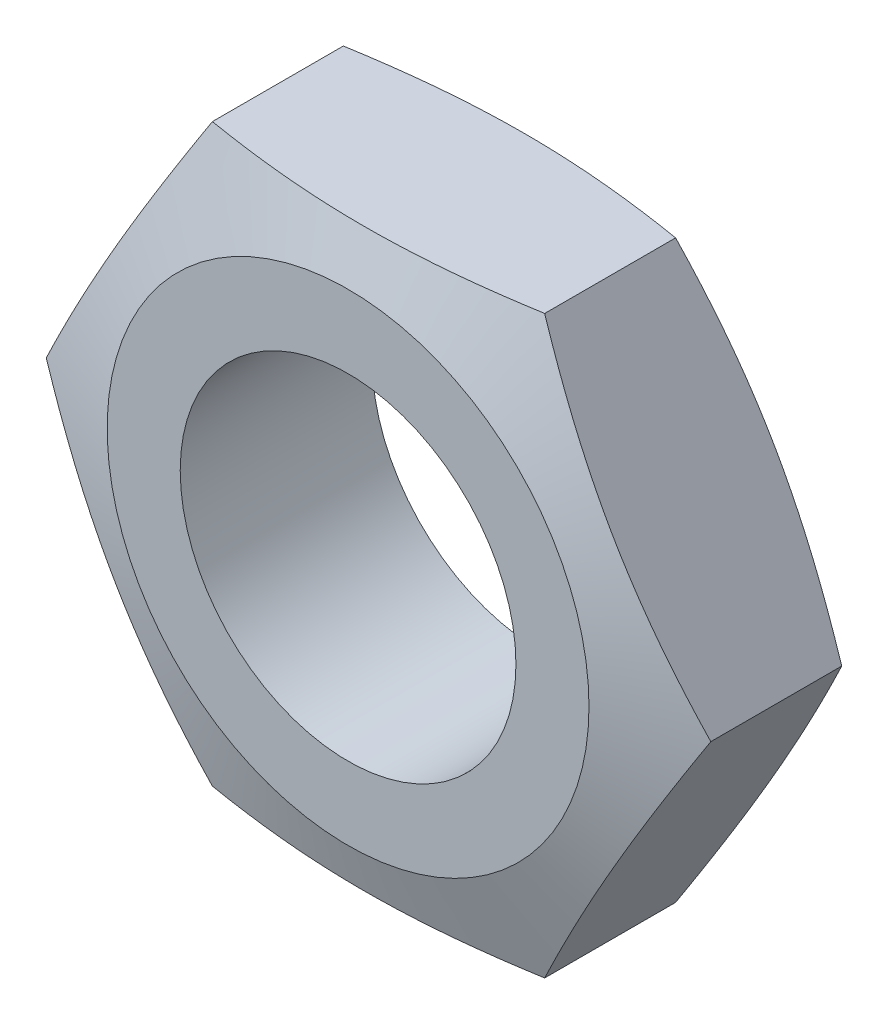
ISO-10303-21;
HEADER;
FILE_DESCRIPTION(('STEP AP214'),'2;1');
FILE_NAME('part.step','',(''),(''),'','','');
FILE_SCHEMA(('AUTOMOTIVE_DESIGN { 1 0 10303 214 1 1 1 1 }'));
ENDSEC;
DATA;
#1=APPLICATION_CONTEXT('core data for automotive mechanical design processes');
#2=APPLICATION_PROTOCOL_DEFINITION('international standard','automotive_design',2000,#1);
#3=PRODUCT_CONTEXT('',#1,'mechanical');
#4=PRODUCT('Part','Part','',(#3));
#5=PRODUCT_RELATED_PRODUCT_CATEGORY('part','',(#4));
#6=PRODUCT_DEFINITION_FORMATION('','',#4);
#7=PRODUCT_DEFINITION_CONTEXT('part definition',#1,'design');
#8=PRODUCT_DEFINITION('design','',#6,#7);
#9=PRODUCT_DEFINITION_SHAPE('','',#8);
#10=(LENGTH_UNIT() NAMED_UNIT(*) SI_UNIT(.MILLI.,.METRE.));
#11=(NAMED_UNIT(*) PLANE_ANGLE_UNIT() SI_UNIT($,.RADIAN.));
#12=(NAMED_UNIT(*) SI_UNIT($,.STERADIAN.) SOLID_ANGLE_UNIT());
#13=UNCERTAINTY_MEASURE_WITH_UNIT(LENGTH_MEASURE(1.E-05),#10,'distance_accuracy_value','');
#14=(GEOMETRIC_REPRESENTATION_CONTEXT(3) GLOBAL_UNCERTAINTY_ASSIGNED_CONTEXT((#13)) GLOBAL_UNIT_ASSIGNED_CONTEXT((#10,
#11,#12)) REPRESENTATION_CONTEXT('',''));
#15=CARTESIAN_POINT('',(0.,0.,0.));
#16=DIRECTION('',(0.,0.,1.));
#17=DIRECTION('',(1.,0.,0.));
#18=AXIS2_PLACEMENT_3D('',#15,#16,#17);
#19=CARTESIAN_POINT('',(-13.856406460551,0.,4.));
#20=DIRECTION('',(0.,0.,1.));
#21=DIRECTION('',(1.,0.,0.));
#22=AXIS2_PLACEMENT_3D('',#19,#20,#21);
#23=PLANE('',#22);
#24=CARTESIAN_POINT('',(0.,0.,4.));
#25=DIRECTION('',(0.,0.,1.));
#26=DIRECTION('',(1.,0.,0.));
#27=AXIS2_PLACEMENT_3D('',#24,#25,#26);
#28=CIRCLE('',#27,10.046406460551);
#29=CARTESIAN_POINT('',(10.046406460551,0.,4.));
#30=VERTEX_POINT('',#29);
#31=EDGE_CURVE('E114',#30,#30,#28,.T.);
#32=ORIENTED_EDGE('',*,*,#31,.T.);
#33=EDGE_LOOP('',(#32));
#34=FACE_BOUND('',#33,.T.);
#35=CARTESIAN_POINT('',(0.,0.,4.));
#36=DIRECTION('',(0.,0.,1.));
#37=DIRECTION('',(1.,0.,0.));
#38=AXIS2_PLACEMENT_3D('',#35,#36,#37);
#39=CIRCLE('',#38,7.);
#40=CARTESIAN_POINT('',(7.,0.,4.));
#41=VERTEX_POINT('',#40);
#42=EDGE_CURVE('E225',#41,#41,#39,.T.);
#43=ORIENTED_EDGE('',*,*,#42,.F.);
#44=EDGE_LOOP('',(#43));
#45=FACE_BOUND('',#44,.T.);
#46=ADVANCED_FACE('F40',(#34,#45),#23,.T.);
#47=CARTESIAN_POINT('',(-13.856406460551,0.,-4.));
#48=DIRECTION('',(0.,0.,1.));
#49=DIRECTION('',(1.,0.,0.));
#50=AXIS2_PLACEMENT_3D('',#47,#48,#49);
#51=PLANE('',#50);
#52=CARTESIAN_POINT('',(0.,0.,-4.));
#53=DIRECTION('',(0.,0.,1.));
#54=DIRECTION('',(1.,0.,0.));
#55=AXIS2_PLACEMENT_3D('',#52,#53,#54);
#56=CIRCLE('',#55,10.046406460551);
#57=CARTESIAN_POINT('',(10.046406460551,0.,-4.));
#58=VERTEX_POINT('',#57);
#59=EDGE_CURVE('E253',#58,#58,#56,.T.);
#60=ORIENTED_EDGE('',*,*,#59,.F.);
#61=EDGE_LOOP('',(#60));
#62=FACE_BOUND('',#61,.T.);
#63=CARTESIAN_POINT('',(0.,0.,-4.));
#64=DIRECTION('',(0.,0.,1.));
#65=DIRECTION('',(1.,0.,0.));
#66=AXIS2_PLACEMENT_3D('',#63,#64,#65);
#67=CIRCLE('',#66,7.);
#68=CARTESIAN_POINT('',(7.,0.,-4.));
#69=VERTEX_POINT('',#68);
#70=EDGE_CURVE('E224',#69,#69,#67,.T.);
#71=ORIENTED_EDGE('',*,*,#70,.T.);
#72=EDGE_LOOP('',(#71));
#73=FACE_BOUND('',#72,.T.);
#74=ADVANCED_FACE('F145',(#62,#73),#51,.F.);
#75=CARTESIAN_POINT('',(-6.92820323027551,12.,4.));
#76=DIRECTION('',(0.866025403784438,-0.5,0.));
#77=DIRECTION('',(0.5,0.866025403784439,0.));
#78=AXIS2_PLACEMENT_3D('',#75,#76,#77);
#79=PLANE('',#78);
#80=DIRECTION('',(0.,0.,-1.));
#81=VECTOR('',#80,1.);
#82=CARTESIAN_POINT('',(-13.856406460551,0.,4.));
#83=LINE('',#82,#81);
#84=CARTESIAN_POINT('',(-13.856406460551,0.,2.73));
#85=VERTEX_POINT('',#84);
#86=CARTESIAN_POINT('',(-13.856406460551,0.,-2.73));
#87=VERTEX_POINT('',#86);
#88=EDGE_CURVE('E128',#85,#87,#83,.T.);
#89=ORIENTED_EDGE('',*,*,#88,.F.);
#90=CARTESIAN_POINT('',(-13.8565219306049,-0.000199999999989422,2.72996150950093));
#91=CARTESIAN_POINT('',(-13.5693206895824,0.497247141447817,2.82573089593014));
#92=CARTESIAN_POINT('',(-13.2813210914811,0.996077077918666,2.9127879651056));
#93=CARTESIAN_POINT('',(-12.7037501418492,1.99645930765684,3.06587653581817));
#94=CARTESIAN_POINT('',(-12.4141778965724,2.49801314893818,3.13189444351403));
#95=CARTESIAN_POINT('',(-11.8361644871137,3.49916174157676,3.23874436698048));
#96=CARTESIAN_POINT('',(-11.547732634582,3.99874036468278,3.27977245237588));
#97=CARTESIAN_POINT('',(-10.9703020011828,4.9988795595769,3.33479716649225));
#98=CARTESIAN_POINT('',(-10.681303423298,5.49943977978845,3.348802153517));
#99=CARTESIAN_POINT('',(-10.1033062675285,6.50056022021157,3.348802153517));
#100=CARTESIAN_POINT('',(-9.81430768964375,7.00112044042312,3.33479716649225));
#101=CARTESIAN_POINT('',(-9.23687705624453,8.00125963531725,3.27977245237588));
#102=CARTESIAN_POINT('',(-8.94844520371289,8.50083825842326,3.23874436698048));
#103=CARTESIAN_POINT('',(-8.37043179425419,9.50198685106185,3.13189444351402));
#104=CARTESIAN_POINT('',(-8.08085954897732,10.0035406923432,3.06587653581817));
#105=CARTESIAN_POINT('',(-7.50328859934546,11.0039229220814,2.9127879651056));
#106=CARTESIAN_POINT('',(-7.21528900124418,11.5027528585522,2.82573089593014));
#107=CARTESIAN_POINT('',(-6.92808776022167,12.0002,2.72996150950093));
#108=B_SPLINE_CURVE_WITH_KNOTS('',3,(#90,#91,#92,#93,#94,#95,#96,#97,#98,#99,#100,#101,#102,
#103,#104,#105,#106,#107),.UNSPECIFIED.,.F.,.F.,(4,2,2,2,2,2,2,2,4),(0.,1.74714237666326,
3.49541134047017,5.22978053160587,6.96361319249,8.69744585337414,10.4318150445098,
12.1800840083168,13.92722638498),.UNSPECIFIED.);
#109=CARTESIAN_POINT('',(-6.92820323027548,12.,2.73));
#110=VERTEX_POINT('',#109);
#111=EDGE_CURVE('E192',#85,#110,#108,.T.);
#112=ORIENTED_EDGE('',*,*,#111,.T.);
#113=DIRECTION('',(0.,0.,-1.));
#114=VECTOR('',#113,1.);
#115=CARTESIAN_POINT('',(-6.92820323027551,12.,4.));
#116=LINE('',#115,#114);
#117=CARTESIAN_POINT('',(-6.92820323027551,12.,-2.72999999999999));
#118=VERTEX_POINT('',#117);
#119=EDGE_CURVE('E69',#110,#118,#116,.T.);
#120=ORIENTED_EDGE('',*,*,#119,.T.);
#121=CARTESIAN_POINT('',(-6.92808776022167,12.0002,-2.72996150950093));
#122=CARTESIAN_POINT('',(-7.21528900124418,11.5027528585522,-2.82573089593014));
#123=CARTESIAN_POINT('',(-7.50328859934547,11.0039229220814,-2.9127879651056));
#124=CARTESIAN_POINT('',(-8.08085954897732,10.0035406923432,-3.06587653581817));
#125=CARTESIAN_POINT('',(-8.37043179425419,9.50198685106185,-3.13189444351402));
#126=CARTESIAN_POINT('',(-8.94844520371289,8.50083825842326,-3.23874436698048));
#127=CARTESIAN_POINT('',(-9.23687705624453,8.00125963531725,-3.27977245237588));
#128=CARTESIAN_POINT('',(-9.81430768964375,7.00112044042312,-3.33479716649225));
#129=CARTESIAN_POINT('',(-10.1033062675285,6.50056022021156,-3.348802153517));
#130=CARTESIAN_POINT('',(-10.681303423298,5.49943977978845,-3.348802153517));
#131=CARTESIAN_POINT('',(-10.9703020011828,4.9988795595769,-3.33479716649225));
#132=CARTESIAN_POINT('',(-11.547732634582,3.99874036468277,-3.27977245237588));
#133=CARTESIAN_POINT('',(-11.8361644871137,3.49916174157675,-3.23874436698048));
#134=CARTESIAN_POINT('',(-12.4141778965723,2.49801314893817,-3.13189444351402));
#135=CARTESIAN_POINT('',(-12.7037501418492,1.99645930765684,-3.06587653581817));
#136=CARTESIAN_POINT('',(-13.2813210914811,0.996077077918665,-2.9127879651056));
#137=CARTESIAN_POINT('',(-13.5693206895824,0.497247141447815,-2.82573089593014));
#138=CARTESIAN_POINT('',(-13.8565219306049,-0.000199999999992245,-2.72996150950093));
#139=B_SPLINE_CURVE_WITH_KNOTS('',3,(#121,#122,#123,#124,#125,#126,#127,#128,#129,#130,#131,
#132,#133,#134,#135,#136,#137,#138),.UNSPECIFIED.,.F.,.F.,(4,2,2,2,2,2,2,2,4),(0.,
1.74714237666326,3.49541134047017,5.22978053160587,6.96361319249,8.69744585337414,
10.4318150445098,12.1800840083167,13.92722638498),.UNSPECIFIED.);
#140=EDGE_CURVE('E213',#118,#87,#139,.T.);
#141=ORIENTED_EDGE('',*,*,#140,.T.);
#142=EDGE_LOOP('',(#89,#112,#120,#141));
#143=FACE_BOUND('',#142,.T.);
#144=ADVANCED_FACE('F42',(#143),#79,.F.);
#145=CARTESIAN_POINT('',(-13.856406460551,0.,4.));
#146=DIRECTION('',(0.866025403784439,0.5,0.));
#147=DIRECTION('',(-0.5,0.866025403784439,0.));
#148=AXIS2_PLACEMENT_3D('',#145,#146,#147);
#149=PLANE('',#148);
#150=DIRECTION('',(0.,0.,-1.));
#151=VECTOR('',#150,1.);
#152=CARTESIAN_POINT('',(-6.92820323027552,-12.,4.));
#153=LINE('',#152,#151);
#154=CARTESIAN_POINT('',(-6.92820323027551,-12.,2.73));
#155=VERTEX_POINT('',#154);
#156=CARTESIAN_POINT('',(-6.92820323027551,-12.,-2.73));
#157=VERTEX_POINT('',#156);
#158=EDGE_CURVE('E122',#155,#157,#153,.T.);
#159=ORIENTED_EDGE('',*,*,#158,.F.);
#160=CARTESIAN_POINT('',(-6.92808776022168,-12.0002,2.72996150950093));
#161=CARTESIAN_POINT('',(-7.21528900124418,-11.5027528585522,2.82573089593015));
#162=CARTESIAN_POINT('',(-7.50328859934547,-11.0039229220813,2.9127879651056));
#163=CARTESIAN_POINT('',(-8.08085954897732,-10.0035406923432,3.06587653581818));
#164=CARTESIAN_POINT('',(-8.37043179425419,-9.50198685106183,3.13189444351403));
#165=CARTESIAN_POINT('',(-8.94844520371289,-8.50083825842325,3.23874436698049));
#166=CARTESIAN_POINT('',(-9.23687705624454,-8.00125963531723,3.27977245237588));
#167=CARTESIAN_POINT('',(-9.81430768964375,-7.0011204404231,3.33479716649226));
#168=CARTESIAN_POINT('',(-10.1033062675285,-6.50056022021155,3.348802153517));
#169=CARTESIAN_POINT('',(-10.681303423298,-5.49943977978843,3.348802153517));
#170=CARTESIAN_POINT('',(-10.9703020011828,-4.99887955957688,3.33479716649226));
#171=CARTESIAN_POINT('',(-11.547732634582,-3.99874036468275,3.27977245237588));
#172=CARTESIAN_POINT('',(-11.8361644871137,-3.49916174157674,3.23874436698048));
#173=CARTESIAN_POINT('',(-12.4141778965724,-2.49801314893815,3.13189444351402));
#174=CARTESIAN_POINT('',(-12.7037501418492,-1.99645930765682,3.06587653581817));
#175=CARTESIAN_POINT('',(-13.2813210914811,-0.996077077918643,2.9127879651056));
#176=CARTESIAN_POINT('',(-13.5693206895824,-0.497247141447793,2.82573089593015));
#177=CARTESIAN_POINT('',(-13.8565219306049,0.000200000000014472,2.72996150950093));
#178=B_SPLINE_CURVE_WITH_KNOTS('',3,(#160,#161,#162,#163,#164,#165,#166,#167,#168,#169,#170,
#171,#172,#173,#174,#175,#176,#177),.UNSPECIFIED.,.F.,.F.,(4,2,2,2,2,2,2,2,4),(0.,
1.74714237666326,3.49541134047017,5.22978053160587,6.96361319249,8.69744585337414,
10.4318150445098,12.1800840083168,13.92722638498),.UNSPECIFIED.);
#179=EDGE_CURVE('E186',#155,#85,#178,.T.);
#180=ORIENTED_EDGE('',*,*,#179,.T.);
#181=ORIENTED_EDGE('',*,*,#88,.T.);
#182=CARTESIAN_POINT('',(-13.8565219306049,0.000200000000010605,-2.72996150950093));
#183=CARTESIAN_POINT('',(-13.5693206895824,-0.497247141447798,-2.82573089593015));
#184=CARTESIAN_POINT('',(-13.2813210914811,-0.996077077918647,-2.9127879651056));
#185=CARTESIAN_POINT('',(-12.7037501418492,-1.99645930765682,-3.06587653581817));
#186=CARTESIAN_POINT('',(-12.4141778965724,-2.49801314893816,-3.13189444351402));
#187=CARTESIAN_POINT('',(-11.8361644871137,-3.49916174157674,-3.23874436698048));
#188=CARTESIAN_POINT('',(-11.547732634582,-3.99874036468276,-3.27977245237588));
#189=CARTESIAN_POINT('',(-10.9703020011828,-4.99887955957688,-3.33479716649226));
#190=CARTESIAN_POINT('',(-10.681303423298,-5.49943977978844,-3.348802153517));
#191=CARTESIAN_POINT('',(-10.1033062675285,-6.50056022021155,-3.348802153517));
#192=CARTESIAN_POINT('',(-9.81430768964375,-7.0011204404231,-3.33479716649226));
#193=CARTESIAN_POINT('',(-9.23687705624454,-8.00125963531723,-3.27977245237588));
#194=CARTESIAN_POINT('',(-8.94844520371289,-8.50083825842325,-3.23874436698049));
#195=CARTESIAN_POINT('',(-8.37043179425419,-9.50198685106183,-3.13189444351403));
#196=CARTESIAN_POINT('',(-8.08085954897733,-10.0035406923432,-3.06587653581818));
#197=CARTESIAN_POINT('',(-7.50328859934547,-11.0039229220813,-2.9127879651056));
#198=CARTESIAN_POINT('',(-7.21528900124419,-11.5027528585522,-2.82573089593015));
#199=CARTESIAN_POINT('',(-6.92808776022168,-12.0002,-2.72996150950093));
#200=B_SPLINE_CURVE_WITH_KNOTS('',3,(#182,#183,#184,#185,#186,#187,#188,#189,#190,#191,#192,
#193,#194,#195,#196,#197,#198,#199),.UNSPECIFIED.,.F.,.F.,(4,2,2,2,2,2,2,2,4),(0.,
1.74714237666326,3.49541134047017,5.22978053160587,6.96361319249,8.69744585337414,
10.4318150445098,12.1800840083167,13.92722638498),.UNSPECIFIED.);
#201=EDGE_CURVE('E205',#87,#157,#200,.T.);
#202=ORIENTED_EDGE('',*,*,#201,.T.);
#203=EDGE_LOOP('',(#159,#180,#181,#202));
#204=FACE_BOUND('',#203,.T.);
#205=ADVANCED_FACE('F197',(#204),#149,.F.);
#206=CARTESIAN_POINT('',(-6.92820323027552,-12.,4.));
#207=DIRECTION('',(0.,1.,0.));
#208=DIRECTION('',(-1.,0.,0.));
#209=AXIS2_PLACEMENT_3D('',#206,#207,#208);
#210=PLANE('',#209);
#211=DIRECTION('',(0.,0.,-1.));
#212=VECTOR('',#211,1.);
#213=CARTESIAN_POINT('',(6.9282032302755,-12.,4.));
#214=LINE('',#213,#212);
#215=CARTESIAN_POINT('',(6.9282032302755,-12.,2.73));
#216=VERTEX_POINT('',#215);
#217=CARTESIAN_POINT('',(6.9282032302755,-12.,-2.73));
#218=VERTEX_POINT('',#217);
#219=EDGE_CURVE('E120',#216,#218,#214,.T.);
#220=ORIENTED_EDGE('',*,*,#219,.F.);
#221=CARTESIAN_POINT('',(-18.2779612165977,-12.,0.060425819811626));
#222=CARTESIAN_POINT('',(-17.7348472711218,-12.,0.211720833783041));
#223=CARTESIAN_POINT('',(-17.1912203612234,-12.,0.361208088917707));
#224=CARTESIAN_POINT('',(-16.1026829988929,-12.,0.655574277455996));
#225=CARTESIAN_POINT('',(-15.5577724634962,-12.,0.800452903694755));
#226=CARTESIAN_POINT('',(-14.4656357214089,-12.,1.08480909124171));
#227=CARTESIAN_POINT('',(-13.9184072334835,-12.,1.22427792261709));
#228=CARTESIAN_POINT('',(-12.8222148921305,-12.,1.49621454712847));
#229=CARTESIAN_POINT('',(-12.2732510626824,-12.,1.62868243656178));
#230=CARTESIAN_POINT('',(-11.1798897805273,-12.,1.88336673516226));
#231=CARTESIAN_POINT('',(-10.6355166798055,-12.,2.00568716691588));
#232=CARTESIAN_POINT('',(-9.54447862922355,-12.,2.2397392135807));
#233=CARTESIAN_POINT('',(-8.99781365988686,-12.,2.35147073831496));
#234=CARTESIAN_POINT('',(-7.90206865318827,-12.,2.56175814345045));
#235=CARTESIAN_POINT('',(-7.35298922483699,-12.,2.66031716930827));
#236=CARTESIAN_POINT('',(-6.25214602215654,-12.,2.84127529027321));
#237=CARTESIAN_POINT('',(-5.70038226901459,-12.,2.92367451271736));
#238=CARTESIAN_POINT('',(-4.60929868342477,-12.,3.06704032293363));
#239=CARTESIAN_POINT('',(-4.07004834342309,-12.,3.12852867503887));
#240=CARTESIAN_POINT('',(-2.98952286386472,-12.,3.23016053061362));
#241=CARTESIAN_POINT('',(-2.44824779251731,-12.,3.27030474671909));
#242=CARTESIAN_POINT('',(-1.3648107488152,-12.,3.32696064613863));
#243=CARTESIAN_POINT('',(-0.822649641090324,-12.,3.34348854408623));
#244=CARTESIAN_POINT('',(0.261866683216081,-12.,3.35193218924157));
#245=CARTESIAN_POINT('',(0.804221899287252,-12.,3.34384800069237));
#246=CARTESIAN_POINT('',(1.89087006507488,-12.,3.30347328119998));
#247=CARTESIAN_POINT('',(2.43515819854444,-12.,3.27105562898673));
#248=CARTESIAN_POINT('',(3.52191763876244,-12.,3.18379595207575));
#249=CARTESIAN_POINT('',(4.06438888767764,-12.,3.12895322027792));
#250=CARTESIAN_POINT('',(5.14747206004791,-12.,2.99959576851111));
#251=CARTESIAN_POINT('',(5.68808170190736,-12.,2.925062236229));
#252=CARTESIAN_POINT('',(6.76673209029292,-12.,2.7594504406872));
#253=CARTESIAN_POINT('',(7.30477282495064,-12.,2.66837210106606));
#254=CARTESIAN_POINT('',(8.36454786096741,-12.,2.47513198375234));
#255=CARTESIAN_POINT('',(8.88634572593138,-12.,2.37331540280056));
#256=CARTESIAN_POINT('',(9.92778573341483,-12.,2.15914397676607));
#257=CARTESIAN_POINT('',(10.447427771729,-12.,2.04678862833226));
#258=CARTESIAN_POINT('',(11.4848706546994,-12.,1.81350505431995));
#259=CARTESIAN_POINT('',(12.0026711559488,-12.,1.69257530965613));
#260=CARTESIAN_POINT('',(13.0365854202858,-12.,1.44377007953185));
#261=CARTESIAN_POINT('',(13.5526992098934,-12.,1.31589470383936));
#262=CARTESIAN_POINT('',(14.583751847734,-12.,1.05441433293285));
#263=CARTESIAN_POINT('',(15.0986899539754,-12.,0.920806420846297));
#264=CARTESIAN_POINT('',(16.1273369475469,-12.,0.648944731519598));
#265=CARTESIAN_POINT('',(16.6410458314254,-12.,0.510690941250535));
#266=CARTESIAN_POINT('',(17.6673585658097,-12.,0.230367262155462));
#267=CARTESIAN_POINT('',(18.1799625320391,-12.,0.0882977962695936));
#268=CARTESIAN_POINT('',(19.2042769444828,-12.,-0.199029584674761));
#269=CARTESIAN_POINT('',(19.715987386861,-12.,-0.344287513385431));
#270=CARTESIAN_POINT('',(21.2359130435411,-12.,-0.780008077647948));
#271=CARTESIAN_POINT('',(22.2430290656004,-12.,-1.07430459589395));
#272=CARTESIAN_POINT('',(24.2550934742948,-12.,-1.67029852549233));
#273=CARTESIAN_POINT('',(25.260041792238,-12.,-1.97199616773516));
#274=CARTESIAN_POINT('',(27.2661167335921,-12.,-2.58021143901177));
#275=CARTESIAN_POINT('',(28.2672469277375,-12.,-2.88671730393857));
#276=CARTESIAN_POINT('',(29.7679581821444,-12.,-3.34956515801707));
#277=CARTESIAN_POINT('',(30.2680180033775,-12.,-3.50435846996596));
#278=CARTESIAN_POINT('',(31.2678533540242,-12.,-3.81485772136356));
#279=CARTESIAN_POINT('',(31.7676288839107,-12.,-3.97056365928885));
#280=CARTESIAN_POINT('',(32.2672805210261,-12.,-4.12666632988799));
#281=B_SPLINE_CURVE_WITH_KNOTS('',3,(#221,#222,#223,#224,#225,#226,#227,#228,#229,#230,#231,
#232,#233,#234,#235,#236,#237,#238,#239,#240,#241,#242,#243,#244,#245,#246,#247,#248,#249,#250,
#251,#252,#253,#254,#255,#256,#257,#258,#259,#260,#261,#262,#263,#264,#265,#266,#267,#268,#269,
#270,#271,#272,#273,#274,#275,#276,#277,#278,#279,#280),.UNSPECIFIED.,.F.,.F.,(4,2,2,2,2,2,2,2,
2,2,2,2,2,2,2,2,2,2,2,2,2,2,2,2,2,2,2,2,2,4),(0.,1.69139044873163,3.38289339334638,
5.07702111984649,6.77112553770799,8.44488148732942,10.1186516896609,11.7920214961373,
13.4653781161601,15.0932432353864,16.7210540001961,18.3477465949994,19.9744349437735,
21.6096809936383,23.24497860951,24.8818442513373,26.5187174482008,28.1135026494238,
29.7083640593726,31.3035087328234,32.8986282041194,34.4945691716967,36.0905146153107,
37.686283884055,39.2820599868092,42.4297178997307,45.5774741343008,48.7184593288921,
50.2888685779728,51.8592752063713),.UNSPECIFIED.);
#282=EDGE_CURVE('E102',#216,#155,#281,.F.);
#283=ORIENTED_EDGE('',*,*,#282,.T.);
#284=ORIENTED_EDGE('',*,*,#158,.T.);
#285=CARTESIAN_POINT('',(-18.2779612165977,-12.,-0.060425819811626));
#286=CARTESIAN_POINT('',(-17.7348472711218,-12.,-0.211720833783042));
#287=CARTESIAN_POINT('',(-17.1912203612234,-12.,-0.361208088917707));
#288=CARTESIAN_POINT('',(-16.1026829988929,-12.,-0.655574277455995));
#289=CARTESIAN_POINT('',(-15.5577724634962,-12.,-0.800452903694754));
#290=CARTESIAN_POINT('',(-14.4656357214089,-12.,-1.08480909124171));
#291=CARTESIAN_POINT('',(-13.9184072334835,-12.,-1.22427792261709));
#292=CARTESIAN_POINT('',(-12.8222148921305,-12.,-1.49621454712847));
#293=CARTESIAN_POINT('',(-12.2732510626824,-12.,-1.62868243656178));
#294=CARTESIAN_POINT('',(-11.1798897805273,-12.,-1.88336673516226));
#295=CARTESIAN_POINT('',(-10.6355166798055,-12.,-2.00568716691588));
#296=CARTESIAN_POINT('',(-9.54447862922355,-12.,-2.2397392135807));
#297=CARTESIAN_POINT('',(-8.99781365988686,-12.,-2.35147073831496));
#298=CARTESIAN_POINT('',(-7.90206865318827,-12.,-2.56175814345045));
#299=CARTESIAN_POINT('',(-7.35298922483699,-12.,-2.66031716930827));
#300=CARTESIAN_POINT('',(-6.25214602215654,-12.,-2.84127529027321));
#301=CARTESIAN_POINT('',(-5.70038226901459,-12.,-2.92367451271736));
#302=CARTESIAN_POINT('',(-4.60929868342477,-12.,-3.06704032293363));
#303=CARTESIAN_POINT('',(-4.07004834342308,-12.,-3.12852867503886));
#304=CARTESIAN_POINT('',(-2.98952286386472,-12.,-3.23016053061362));
#305=CARTESIAN_POINT('',(-2.44824779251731,-12.,-3.27030474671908));
#306=CARTESIAN_POINT('',(-1.3648107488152,-12.,-3.32696064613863));
#307=CARTESIAN_POINT('',(-0.822649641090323,-12.,-3.34348854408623));
#308=CARTESIAN_POINT('',(0.261866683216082,-12.,-3.35193218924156));
#309=CARTESIAN_POINT('',(0.804221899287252,-12.,-3.34384800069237));
#310=CARTESIAN_POINT('',(1.89087006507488,-12.,-3.30347328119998));
#311=CARTESIAN_POINT('',(2.43515819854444,-12.,-3.27105562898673));
#312=CARTESIAN_POINT('',(3.52191763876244,-12.,-3.18379595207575));
#313=CARTESIAN_POINT('',(4.06438888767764,-12.,-3.12895322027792));
#314=CARTESIAN_POINT('',(5.14747206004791,-12.,-2.99959576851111));
#315=CARTESIAN_POINT('',(5.68808170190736,-12.,-2.925062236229));
#316=CARTESIAN_POINT('',(6.76673209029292,-12.,-2.7594504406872));
#317=CARTESIAN_POINT('',(7.30477282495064,-12.,-2.66837210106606));
#318=CARTESIAN_POINT('',(8.36454786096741,-12.,-2.47513198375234));
#319=CARTESIAN_POINT('',(8.88634572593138,-12.,-2.37331540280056));
#320=CARTESIAN_POINT('',(9.92778573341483,-12.,-2.15914397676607));
#321=CARTESIAN_POINT('',(10.447427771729,-12.,-2.04678862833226));
#322=CARTESIAN_POINT('',(11.4848706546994,-12.,-1.81350505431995));
#323=CARTESIAN_POINT('',(12.0026711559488,-12.,-1.69257530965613));
#324=CARTESIAN_POINT('',(13.0365854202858,-12.,-1.44377007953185));
#325=CARTESIAN_POINT('',(13.5526992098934,-12.,-1.31589470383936));
#326=CARTESIAN_POINT('',(14.583751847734,-12.,-1.05441433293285));
#327=CARTESIAN_POINT('',(15.0986899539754,-12.,-0.920806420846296));
#328=CARTESIAN_POINT('',(16.1273369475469,-12.,-0.648944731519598));
#329=CARTESIAN_POINT('',(16.6410458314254,-12.,-0.510690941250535));
#330=CARTESIAN_POINT('',(17.6673585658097,-12.,-0.230367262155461));
#331=CARTESIAN_POINT('',(18.1799625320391,-12.,-0.0882977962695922));
#332=CARTESIAN_POINT('',(19.2042769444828,-12.,0.199029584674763));
#333=CARTESIAN_POINT('',(19.715987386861,-12.,0.344287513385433));
#334=CARTESIAN_POINT('',(21.2359130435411,-12.,0.780008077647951));
#335=CARTESIAN_POINT('',(22.2430290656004,-12.,1.07430459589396));
#336=CARTESIAN_POINT('',(24.2550934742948,-12.,1.67029852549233));
#337=CARTESIAN_POINT('',(25.260041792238,-12.,1.97199616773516));
#338=CARTESIAN_POINT('',(27.2661167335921,-12.,2.58021143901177));
#339=CARTESIAN_POINT('',(28.2672469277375,-12.,2.88671730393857));
#340=CARTESIAN_POINT('',(29.7679581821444,-12.,3.34956515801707));
#341=CARTESIAN_POINT('',(30.2680180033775,-12.,3.50435846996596));
#342=CARTESIAN_POINT('',(31.2678533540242,-12.,3.81485772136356));
#343=CARTESIAN_POINT('',(31.7676288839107,-12.,3.97056365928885));
#344=CARTESIAN_POINT('',(32.2672805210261,-12.,4.12666632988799));
#345=B_SPLINE_CURVE_WITH_KNOTS('',3,(#285,#286,#287,#288,#289,#290,#291,#292,#293,#294,#295,
#296,#297,#298,#299,#300,#301,#302,#303,#304,#305,#306,#307,#308,#309,#310,#311,#312,#313,#314,
#315,#316,#317,#318,#319,#320,#321,#322,#323,#324,#325,#326,#327,#328,#329,#330,#331,#332,#333,
#334,#335,#336,#337,#338,#339,#340,#341,#342,#343,#344),.UNSPECIFIED.,.F.,.F.,(4,2,2,2,2,2,2,2,
2,2,2,2,2,2,2,2,2,2,2,2,2,2,2,2,2,2,2,2,2,4),(0.,1.69139044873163,3.38289339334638,
5.07702111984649,6.771125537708,8.44488148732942,10.1186516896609,11.7920214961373,
13.4653781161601,15.0932432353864,16.7210540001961,18.3477465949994,19.9744349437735,
21.6096809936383,23.24497860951,24.8818442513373,26.5187174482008,28.1135026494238,
29.7083640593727,31.3035087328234,32.8986282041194,34.4945691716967,36.0905146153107,
37.686283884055,39.2820599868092,42.4297178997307,45.5774741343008,48.7184593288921,
50.2888685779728,51.8592752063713),.UNSPECIFIED.);
#346=EDGE_CURVE('E214',#157,#218,#345,.T.);
#347=ORIENTED_EDGE('',*,*,#346,.T.);
#348=EDGE_LOOP('',(#220,#283,#284,#347));
#349=FACE_BOUND('',#348,.T.);
#350=ADVANCED_FACE('F200',(#349),#210,.F.);
#351=CARTESIAN_POINT('',(6.9282032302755,-12.,4.));
#352=DIRECTION('',(-0.866025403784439,0.5,0.));
#353=DIRECTION('',(-0.5,-0.866025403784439,0.));
#354=AXIS2_PLACEMENT_3D('',#351,#352,#353);
#355=PLANE('',#354);
#356=DIRECTION('',(0.,0.,-1.));
#357=VECTOR('',#356,1.);
#358=CARTESIAN_POINT('',(13.856406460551,0.,4.));
#359=LINE('',#358,#357);
#360=CARTESIAN_POINT('',(13.856406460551,0.,2.73));
#361=VERTEX_POINT('',#360);
#362=CARTESIAN_POINT('',(13.856406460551,0.,-2.73));
#363=VERTEX_POINT('',#362);
#364=EDGE_CURVE('E111',#361,#363,#359,.T.);
#365=ORIENTED_EDGE('',*,*,#364,.F.);
#366=CARTESIAN_POINT('',(13.8565219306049,0.000200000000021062,2.72996150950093));
#367=CARTESIAN_POINT('',(13.5693206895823,-0.497247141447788,2.82573089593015));
#368=CARTESIAN_POINT('',(13.2813210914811,-0.996077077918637,2.9127879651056));
#369=CARTESIAN_POINT('',(12.7037501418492,-1.99645930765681,3.06587653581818));
#370=CARTESIAN_POINT('',(12.4141778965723,-2.49801314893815,3.13189444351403));
#371=CARTESIAN_POINT('',(11.8361644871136,-3.49916174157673,3.23874436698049));
#372=CARTESIAN_POINT('',(11.547732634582,-3.99874036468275,3.27977245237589));
#373=CARTESIAN_POINT('',(10.9703020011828,-4.99887955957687,3.33479716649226));
#374=CARTESIAN_POINT('',(10.681303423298,-5.49943977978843,3.34880215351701));
#375=CARTESIAN_POINT('',(10.1033062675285,-6.50056022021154,3.34880215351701));
#376=CARTESIAN_POINT('',(9.81430768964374,-7.0011204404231,3.33479716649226));
#377=CARTESIAN_POINT('',(9.23687705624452,-8.00125963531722,3.27977245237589));
#378=CARTESIAN_POINT('',(8.94844520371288,-8.50083825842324,3.23874436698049));
#379=CARTESIAN_POINT('',(8.37043179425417,-9.50198685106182,3.13189444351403));
#380=CARTESIAN_POINT('',(8.0808595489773,-10.0035406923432,3.06587653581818));
#381=CARTESIAN_POINT('',(7.50328859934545,-11.0039229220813,2.9127879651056));
#382=CARTESIAN_POINT('',(7.21528900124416,-11.5027528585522,2.82573089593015));
#383=CARTESIAN_POINT('',(6.92808776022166,-12.0002,2.72996150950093));
#384=B_SPLINE_CURVE_WITH_KNOTS('',3,(#366,#367,#368,#369,#370,#371,#372,#373,#374,#375,#376,
#377,#378,#379,#380,#381,#382,#383),.UNSPECIFIED.,.F.,.F.,(4,2,2,2,2,2,2,2,4),(0.,
1.74714237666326,3.49541134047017,5.22978053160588,6.96361319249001,8.69744585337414,
10.4318150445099,12.1800840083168,13.92722638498),.UNSPECIFIED.);
#385=EDGE_CURVE('E99',#361,#216,#384,.T.);
#386=ORIENTED_EDGE('',*,*,#385,.T.);
#387=ORIENTED_EDGE('',*,*,#219,.T.);
#388=CARTESIAN_POINT('',(6.92808776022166,-12.0002,-2.72996150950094));
#389=CARTESIAN_POINT('',(7.21528900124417,-11.5027528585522,-2.82573089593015));
#390=CARTESIAN_POINT('',(7.50328859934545,-11.0039229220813,-2.9127879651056));
#391=CARTESIAN_POINT('',(8.08085954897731,-10.0035406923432,-3.06587653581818));
#392=CARTESIAN_POINT('',(8.37043179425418,-9.50198685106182,-3.13189444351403));
#393=CARTESIAN_POINT('',(8.94844520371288,-8.50083825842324,-3.23874436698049));
#394=CARTESIAN_POINT('',(9.23687705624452,-8.00125963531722,-3.27977245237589));
#395=CARTESIAN_POINT('',(9.81430768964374,-7.00112044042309,-3.33479716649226));
#396=CARTESIAN_POINT('',(10.1033062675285,-6.50056022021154,-3.34880215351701));
#397=CARTESIAN_POINT('',(10.681303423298,-5.49943977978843,-3.34880215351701));
#398=CARTESIAN_POINT('',(10.9703020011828,-4.99887955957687,-3.33479716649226));
#399=CARTESIAN_POINT('',(11.547732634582,-3.99874036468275,-3.27977245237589));
#400=CARTESIAN_POINT('',(11.8361644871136,-3.49916174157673,-3.23874436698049));
#401=CARTESIAN_POINT('',(12.4141778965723,-2.49801314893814,-3.13189444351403));
#402=CARTESIAN_POINT('',(12.7037501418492,-1.99645930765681,-3.06587653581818));
#403=CARTESIAN_POINT('',(13.2813210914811,-0.996077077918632,-2.9127879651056));
#404=CARTESIAN_POINT('',(13.5693206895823,-0.497247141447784,-2.82573089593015));
#405=CARTESIAN_POINT('',(13.8565219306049,0.000200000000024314,-2.72996150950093));
#406=B_SPLINE_CURVE_WITH_KNOTS('',3,(#388,#389,#390,#391,#392,#393,#394,#395,#396,#397,#398,
#399,#400,#401,#402,#403,#404,#405),.UNSPECIFIED.,.F.,.F.,(4,2,2,2,2,2,2,2,4),(0.,
1.74714237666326,3.49541134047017,5.22978053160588,6.96361319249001,8.69744585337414,
10.4318150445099,12.1800840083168,13.92722638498),.UNSPECIFIED.);
#407=EDGE_CURVE('E119',#218,#363,#406,.T.);
#408=ORIENTED_EDGE('',*,*,#407,.T.);
#409=EDGE_LOOP('',(#365,#386,#387,#408));
#410=FACE_BOUND('',#409,.T.);
#411=ADVANCED_FACE('F117',(#410),#355,.F.);
#412=CARTESIAN_POINT('',(13.856406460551,0.,4.));
#413=DIRECTION('',(-0.866025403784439,-0.5,0.));
#414=DIRECTION('',(0.5,-0.866025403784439,0.));
#415=AXIS2_PLACEMENT_3D('',#412,#413,#414);
#416=PLANE('',#415);
#417=DIRECTION('',(0.,0.,-1.));
#418=VECTOR('',#417,1.);
#419=CARTESIAN_POINT('',(6.92820323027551,12.,4.));
#420=LINE('',#419,#418);
#421=CARTESIAN_POINT('',(6.92820323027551,12.,2.72999999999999));
#422=VERTEX_POINT('',#421);
#423=CARTESIAN_POINT('',(6.92820323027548,12.,-2.73));
#424=VERTEX_POINT('',#423);
#425=EDGE_CURVE('E113',#422,#424,#420,.T.);
#426=ORIENTED_EDGE('',*,*,#425,.F.);
#427=CARTESIAN_POINT('',(6.92808776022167,12.0002,2.72996150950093));
#428=CARTESIAN_POINT('',(7.21528900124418,11.5027528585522,2.82573089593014));
#429=CARTESIAN_POINT('',(7.50328859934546,11.0039229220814,2.9127879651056));
#430=CARTESIAN_POINT('',(8.08085954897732,10.0035406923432,3.06587653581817));
#431=CARTESIAN_POINT('',(8.37043179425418,9.50198685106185,3.13189444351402));
#432=CARTESIAN_POINT('',(8.94844520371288,8.50083825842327,3.23874436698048));
#433=CARTESIAN_POINT('',(9.23687705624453,8.00125963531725,3.27977245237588));
#434=CARTESIAN_POINT('',(9.81430768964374,7.00112044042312,3.33479716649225));
#435=CARTESIAN_POINT('',(10.1033062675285,6.50056022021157,3.348802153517));
#436=CARTESIAN_POINT('',(10.681303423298,5.49943977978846,3.348802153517));
#437=CARTESIAN_POINT('',(10.9703020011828,4.99887955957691,3.33479716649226));
#438=CARTESIAN_POINT('',(11.547732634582,3.99874036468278,3.27977245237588));
#439=CARTESIAN_POINT('',(11.8361644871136,3.49916174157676,3.23874436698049));
#440=CARTESIAN_POINT('',(12.4141778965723,2.49801314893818,3.13189444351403));
#441=CARTESIAN_POINT('',(12.7037501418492,1.99645930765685,3.06587653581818));
#442=CARTESIAN_POINT('',(13.2813210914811,0.996077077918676,2.9127879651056));
#443=CARTESIAN_POINT('',(13.5693206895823,0.497247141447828,2.82573089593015));
#444=CARTESIAN_POINT('',(13.8565219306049,-0.000199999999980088,2.72996150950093));
#445=B_SPLINE_CURVE_WITH_KNOTS('',3,(#427,#428,#429,#430,#431,#432,#433,#434,#435,#436,#437,
#438,#439,#440,#441,#442,#443,#444),.UNSPECIFIED.,.F.,.F.,(4,2,2,2,2,2,2,2,4),(0.,
1.74714237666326,3.49541134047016,5.22978053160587,6.96361319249,8.69744585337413,
10.4318150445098,12.1800840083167,13.92722638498),.UNSPECIFIED.);
#446=EDGE_CURVE('E62',#422,#361,#445,.T.);
#447=ORIENTED_EDGE('',*,*,#446,.T.);
#448=ORIENTED_EDGE('',*,*,#364,.T.);
#449=CARTESIAN_POINT('',(13.8565219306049,-0.000199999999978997,-2.72996150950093));
#450=CARTESIAN_POINT('',(13.5693206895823,0.497247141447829,-2.82573089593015));
#451=CARTESIAN_POINT('',(13.2813210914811,0.996077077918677,-2.9127879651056));
#452=CARTESIAN_POINT('',(12.7037501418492,1.99645930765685,-3.06587653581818));
#453=CARTESIAN_POINT('',(12.4141778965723,2.49801314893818,-3.13189444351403));
#454=CARTESIAN_POINT('',(11.8361644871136,3.49916174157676,-3.23874436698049));
#455=CARTESIAN_POINT('',(11.547732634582,3.99874036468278,-3.27977245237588));
#456=CARTESIAN_POINT('',(10.9703020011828,4.99887955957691,-3.33479716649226));
#457=CARTESIAN_POINT('',(10.681303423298,5.49943977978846,-3.348802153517));
#458=CARTESIAN_POINT('',(10.1033062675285,6.50056022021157,-3.348802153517));
#459=CARTESIAN_POINT('',(9.81430768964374,7.00112044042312,-3.33479716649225));
#460=CARTESIAN_POINT('',(9.23687705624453,8.00125963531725,-3.27977245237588));
#461=CARTESIAN_POINT('',(8.94844520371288,8.50083825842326,-3.23874436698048));
#462=CARTESIAN_POINT('',(8.37043179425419,9.50198685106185,-3.13189444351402));
#463=CARTESIAN_POINT('',(8.08085954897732,10.0035406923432,-3.06587653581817));
#464=CARTESIAN_POINT('',(7.50328859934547,11.0039229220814,-2.9127879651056));
#465=CARTESIAN_POINT('',(7.21528900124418,11.5027528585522,-2.82573089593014));
#466=CARTESIAN_POINT('',(6.92808776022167,12.0002,-2.72996150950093));
#467=B_SPLINE_CURVE_WITH_KNOTS('',3,(#449,#450,#451,#452,#453,#454,#455,#456,#457,#458,#459,
#460,#461,#462,#463,#464,#465,#466),.UNSPECIFIED.,.F.,.F.,(4,2,2,2,2,2,2,2,4),(0.,
1.74714237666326,3.49541134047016,5.22978053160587,6.96361319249,8.69744585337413,
10.4318150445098,12.1800840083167,13.92722638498),.UNSPECIFIED.);
#468=EDGE_CURVE('E155',#363,#424,#467,.T.);
#469=ORIENTED_EDGE('',*,*,#468,.T.);
#470=EDGE_LOOP('',(#426,#447,#448,#469));
#471=FACE_BOUND('',#470,.T.);
#472=ADVANCED_FACE('F109',(#471),#416,.F.);
#473=CARTESIAN_POINT('',(6.92820323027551,12.,4.));
#474=DIRECTION('',(0.,-1.,0.));
#475=DIRECTION('',(1.,0.,0.));
#476=AXIS2_PLACEMENT_3D('',#473,#474,#475);
#477=PLANE('',#476);
#478=ORIENTED_EDGE('',*,*,#119,.F.);
#479=CARTESIAN_POINT('',(-18.2779612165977,12.,0.0604258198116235));
#480=CARTESIAN_POINT('',(-17.7348472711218,12.,0.211720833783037));
#481=CARTESIAN_POINT('',(-17.1912203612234,12.,0.361208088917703));
#482=CARTESIAN_POINT('',(-16.1026829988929,12.,0.655574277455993));
#483=CARTESIAN_POINT('',(-15.5577724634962,12.,0.800452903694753));
#484=CARTESIAN_POINT('',(-14.4656357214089,12.,1.0848090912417));
#485=CARTESIAN_POINT('',(-13.9184072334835,12.,1.22427792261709));
#486=CARTESIAN_POINT('',(-12.8222148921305,12.,1.49621454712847));
#487=CARTESIAN_POINT('',(-12.2732510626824,12.,1.62868243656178));
#488=CARTESIAN_POINT('',(-11.1798897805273,12.,1.88336673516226));
#489=CARTESIAN_POINT('',(-10.6355166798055,12.,2.00568716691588));
#490=CARTESIAN_POINT('',(-9.54447862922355,12.,2.2397392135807));
#491=CARTESIAN_POINT('',(-8.99781365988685,12.,2.35147073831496));
#492=CARTESIAN_POINT('',(-7.90206865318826,12.,2.56175814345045));
#493=CARTESIAN_POINT('',(-7.35298922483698,12.,2.66031716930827));
#494=CARTESIAN_POINT('',(-6.25214602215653,12.,2.84127529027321));
#495=CARTESIAN_POINT('',(-5.70038226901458,12.,2.92367451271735));
#496=CARTESIAN_POINT('',(-4.60929868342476,12.,3.06704032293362));
#497=CARTESIAN_POINT('',(-4.07004834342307,12.,3.12852867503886));
#498=CARTESIAN_POINT('',(-2.98952286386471,12.,3.23016053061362));
#499=CARTESIAN_POINT('',(-2.4482477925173,12.,3.27030474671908));
#500=CARTESIAN_POINT('',(-1.36481074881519,12.,3.32696064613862));
#501=CARTESIAN_POINT('',(-0.822649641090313,12.,3.34348854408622));
#502=CARTESIAN_POINT('',(0.261866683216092,12.,3.35193218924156));
#503=CARTESIAN_POINT('',(0.804221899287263,12.,3.34384800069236));
#504=CARTESIAN_POINT('',(1.89087006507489,12.,3.30347328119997));
#505=CARTESIAN_POINT('',(2.43515819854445,12.,3.27105562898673));
#506=CARTESIAN_POINT('',(3.52191763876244,12.,3.18379595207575));
#507=CARTESIAN_POINT('',(4.06438888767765,12.,3.12895322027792));
#508=CARTESIAN_POINT('',(5.14747206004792,12.,2.99959576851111));
#509=CARTESIAN_POINT('',(5.68808170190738,12.,2.925062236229));
#510=CARTESIAN_POINT('',(6.76673209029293,12.,2.7594504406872));
#511=CARTESIAN_POINT('',(7.30477282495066,12.,2.66837210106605));
#512=CARTESIAN_POINT('',(8.36454786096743,12.,2.47513198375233));
#513=CARTESIAN_POINT('',(8.8863457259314,12.,2.37331540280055));
#514=CARTESIAN_POINT('',(9.92778573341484,12.,2.15914397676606));
#515=CARTESIAN_POINT('',(10.447427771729,12.,2.04678862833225));
#516=CARTESIAN_POINT('',(11.4848706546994,12.,1.81350505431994));
#517=CARTESIAN_POINT('',(12.0026711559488,12.,1.69257530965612));
#518=CARTESIAN_POINT('',(13.0365854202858,12.,1.44377007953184));
#519=CARTESIAN_POINT('',(13.5526992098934,12.,1.31589470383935));
#520=CARTESIAN_POINT('',(14.583751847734,12.,1.05441433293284));
#521=CARTESIAN_POINT('',(15.0986899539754,12.,0.920806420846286));
#522=CARTESIAN_POINT('',(16.1273369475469,12.,0.648944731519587));
#523=CARTESIAN_POINT('',(16.6410458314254,12.,0.510690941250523));
#524=CARTESIAN_POINT('',(17.6673585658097,12.,0.230367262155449));
#525=CARTESIAN_POINT('',(18.1799625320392,12.,0.0882977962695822));
#526=CARTESIAN_POINT('',(19.2042769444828,12.,-0.199029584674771));
#527=CARTESIAN_POINT('',(19.715987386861,12.,-0.34428751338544));
#528=CARTESIAN_POINT('',(21.2359130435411,12.,-0.780008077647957));
#529=CARTESIAN_POINT('',(22.2430290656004,12.,-1.07430459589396));
#530=CARTESIAN_POINT('',(24.2550934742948,12.,-1.67029852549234));
#531=CARTESIAN_POINT('',(25.260041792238,12.,-1.97199616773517));
#532=CARTESIAN_POINT('',(27.2661167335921,12.,-2.58021143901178));
#533=CARTESIAN_POINT('',(28.2672469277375,12.,-2.88671730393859));
#534=CARTESIAN_POINT('',(29.7679581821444,12.,-3.34956515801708));
#535=CARTESIAN_POINT('',(30.2680180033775,12.,-3.50435846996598));
#536=CARTESIAN_POINT('',(31.2678533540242,12.,-3.81485772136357));
#537=CARTESIAN_POINT('',(31.7676288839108,12.,-3.97056365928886));
#538=CARTESIAN_POINT('',(32.2672805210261,12.,-4.126666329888));
#539=B_SPLINE_CURVE_WITH_KNOTS('',3,(#479,#480,#481,#482,#483,#484,#485,#486,#487,#488,#489,
#490,#491,#492,#493,#494,#495,#496,#497,#498,#499,#500,#501,#502,#503,#504,#505,#506,#507,#508,
#509,#510,#511,#512,#513,#514,#515,#516,#517,#518,#519,#520,#521,#522,#523,#524,#525,#526,#527,
#528,#529,#530,#531,#532,#533,#534,#535,#536,#537,#538),.UNSPECIFIED.,.F.,.F.,(4,2,2,2,2,2,2,2,
2,2,2,2,2,2,2,2,2,2,2,2,2,2,2,2,2,2,2,2,2,4),(0.,1.69139044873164,3.38289339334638,
5.0770211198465,6.771125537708,8.44488148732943,10.1186516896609,11.7920214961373,
13.4653781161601,15.0932432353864,16.7210540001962,18.3477465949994,19.9744349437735,
21.6096809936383,23.24497860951,24.8818442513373,26.5187174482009,28.1135026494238,
29.7083640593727,31.3035087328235,32.8986282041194,34.4945691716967,36.0905146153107,
37.686283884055,39.2820599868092,42.4297178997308,45.5774741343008,48.7184593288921,
50.2888685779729,51.8592752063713),.UNSPECIFIED.);
#540=EDGE_CURVE('E11',#110,#422,#539,.T.);
#541=ORIENTED_EDGE('',*,*,#540,.T.);
#542=ORIENTED_EDGE('',*,*,#425,.T.);
#543=CARTESIAN_POINT('',(-18.2779612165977,12.,-0.0604258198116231));
#544=CARTESIAN_POINT('',(-17.7348472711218,12.,-0.211720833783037));
#545=CARTESIAN_POINT('',(-17.1912203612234,12.,-0.361208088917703));
#546=CARTESIAN_POINT('',(-16.1026829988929,12.,-0.655574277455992));
#547=CARTESIAN_POINT('',(-15.5577724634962,12.,-0.800452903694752));
#548=CARTESIAN_POINT('',(-14.4656357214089,12.,-1.0848090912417));
#549=CARTESIAN_POINT('',(-13.9184072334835,12.,-1.22427792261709));
#550=CARTESIAN_POINT('',(-12.8222148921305,12.,-1.49621454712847));
#551=CARTESIAN_POINT('',(-12.2732510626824,12.,-1.62868243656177));
#552=CARTESIAN_POINT('',(-11.1798897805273,12.,-1.88336673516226));
#553=CARTESIAN_POINT('',(-10.6355166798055,12.,-2.00568716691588));
#554=CARTESIAN_POINT('',(-9.54447862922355,12.,-2.23973921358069));
#555=CARTESIAN_POINT('',(-8.99781365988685,12.,-2.35147073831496));
#556=CARTESIAN_POINT('',(-7.90206865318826,12.,-2.56175814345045));
#557=CARTESIAN_POINT('',(-7.35298922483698,12.,-2.66031716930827));
#558=CARTESIAN_POINT('',(-6.25214602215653,12.,-2.84127529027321));
#559=CARTESIAN_POINT('',(-5.70038226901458,12.,-2.92367451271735));
#560=CARTESIAN_POINT('',(-4.60929868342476,12.,-3.06704032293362));
#561=CARTESIAN_POINT('',(-4.07004834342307,12.,-3.12852867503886));
#562=CARTESIAN_POINT('',(-2.98952286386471,12.,-3.23016053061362));
#563=CARTESIAN_POINT('',(-2.4482477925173,12.,-3.27030474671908));
#564=CARTESIAN_POINT('',(-1.36481074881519,12.,-3.32696064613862));
#565=CARTESIAN_POINT('',(-0.822649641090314,12.,-3.34348854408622));
#566=CARTESIAN_POINT('',(0.261866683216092,12.,-3.35193218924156));
#567=CARTESIAN_POINT('',(0.804221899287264,12.,-3.34384800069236));
#568=CARTESIAN_POINT('',(1.8908700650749,12.,-3.30347328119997));
#569=CARTESIAN_POINT('',(2.43515819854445,12.,-3.27105562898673));
#570=CARTESIAN_POINT('',(3.52191763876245,12.,-3.18379595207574));
#571=CARTESIAN_POINT('',(4.06438888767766,12.,-3.12895322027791));
#572=CARTESIAN_POINT('',(5.14747206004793,12.,-2.99959576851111));
#573=CARTESIAN_POINT('',(5.68808170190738,12.,-2.92506223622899));
#574=CARTESIAN_POINT('',(6.76673209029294,12.,-2.7594504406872));
#575=CARTESIAN_POINT('',(7.30477282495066,12.,-2.66837210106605));
#576=CARTESIAN_POINT('',(8.36454786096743,12.,-2.47513198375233));
#577=CARTESIAN_POINT('',(8.8863457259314,12.,-2.37331540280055));
#578=CARTESIAN_POINT('',(9.92778573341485,12.,-2.15914397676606));
#579=CARTESIAN_POINT('',(10.447427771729,12.,-2.04678862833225));
#580=CARTESIAN_POINT('',(11.4848706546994,12.,-1.81350505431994));
#581=CARTESIAN_POINT('',(12.0026711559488,12.,-1.69257530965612));
#582=CARTESIAN_POINT('',(13.0365854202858,12.,-1.44377007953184));
#583=CARTESIAN_POINT('',(13.5526992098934,12.,-1.31589470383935));
#584=CARTESIAN_POINT('',(14.583751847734,12.,-1.05441433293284));
#585=CARTESIAN_POINT('',(15.0986899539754,12.,-0.920806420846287));
#586=CARTESIAN_POINT('',(16.1273369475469,12.,-0.648944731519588));
#587=CARTESIAN_POINT('',(16.6410458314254,12.,-0.510690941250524));
#588=CARTESIAN_POINT('',(17.6673585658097,12.,-0.23036726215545));
#589=CARTESIAN_POINT('',(18.1799625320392,12.,-0.0882977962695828));
#590=CARTESIAN_POINT('',(19.2042769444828,12.,0.199029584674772));
#591=CARTESIAN_POINT('',(19.715987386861,12.,0.344287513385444));
#592=CARTESIAN_POINT('',(21.2359130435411,12.,0.780008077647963));
#593=CARTESIAN_POINT('',(22.2430290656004,12.,1.07430459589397));
#594=CARTESIAN_POINT('',(24.2550934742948,12.,1.67029852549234));
#595=CARTESIAN_POINT('',(25.260041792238,12.,1.97199616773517));
#596=CARTESIAN_POINT('',(27.2661167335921,12.,2.58021143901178));
#597=CARTESIAN_POINT('',(28.2672469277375,12.,2.88671730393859));
#598=CARTESIAN_POINT('',(29.7679581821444,12.,3.34956515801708));
#599=CARTESIAN_POINT('',(30.2680180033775,12.,3.50435846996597));
#600=CARTESIAN_POINT('',(31.2678533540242,12.,3.81485772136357));
#601=CARTESIAN_POINT('',(31.7676288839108,12.,3.97056365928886));
#602=CARTESIAN_POINT('',(32.2672805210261,12.,4.126666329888));
#603=B_SPLINE_CURVE_WITH_KNOTS('',3,(#543,#544,#545,#546,#547,#548,#549,#550,#551,#552,#553,
#554,#555,#556,#557,#558,#559,#560,#561,#562,#563,#564,#565,#566,#567,#568,#569,#570,#571,#572,
#573,#574,#575,#576,#577,#578,#579,#580,#581,#582,#583,#584,#585,#586,#587,#588,#589,#590,#591,
#592,#593,#594,#595,#596,#597,#598,#599,#600,#601,#602),.UNSPECIFIED.,.F.,.F.,(4,2,2,2,2,2,2,2,
2,2,2,2,2,2,2,2,2,2,2,2,2,2,2,2,2,2,2,2,2,4),(0.,1.69139044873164,3.38289339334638,
5.0770211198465,6.771125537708,8.44488148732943,10.1186516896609,11.7920214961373,
13.4653781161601,15.0932432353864,16.7210540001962,18.3477465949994,19.9744349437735,
21.6096809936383,23.24497860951,24.8818442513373,26.5187174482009,28.1135026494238,
29.7083640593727,31.3035087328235,32.8986282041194,34.4945691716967,36.0905146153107,
37.686283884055,39.2820599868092,42.4297178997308,45.5774741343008,48.7184593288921,
50.2888685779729,51.8592752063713),.UNSPECIFIED.);
#604=EDGE_CURVE('E55',#424,#118,#603,.F.);
#605=ORIENTED_EDGE('',*,*,#604,.T.);
#606=EDGE_LOOP('',(#478,#541,#542,#605));
#607=FACE_BOUND('',#606,.T.);
#608=ADVANCED_FACE('F138',(#607),#477,.F.);
#609=CARTESIAN_POINT('',(0.,0.,4.));
#610=DIRECTION('',(0.,0.,-1.));
#611=DIRECTION('',(-1.,0.,0.));
#612=AXIS2_PLACEMENT_3D('',#609,#610,#611);
#613=CYLINDRICAL_SURFACE('',#612,7.);
#614=ORIENTED_EDGE('',*,*,#42,.T.);
#615=EDGE_LOOP('',(#614));
#616=FACE_BOUND('',#615,.T.);
#617=ORIENTED_EDGE('',*,*,#70,.F.);
#618=EDGE_LOOP('',(#617));
#619=FACE_BOUND('',#618,.T.);
#620=ADVANCED_FACE('F143',(#616,#619),#613,.F.);
#621=CARTESIAN_POINT('',(0.,0.,-4.));
#622=DIRECTION('',(0.,0.,1.));
#623=DIRECTION('',(1.,0.,0.));
#624=AXIS2_PLACEMENT_3D('',#621,#622,#623);
#625=CONICAL_SURFACE('',#624,10.046406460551,1.24904577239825);
#626=ORIENTED_EDGE('',*,*,#59,.T.);
#627=EDGE_LOOP('',(#626));
#628=FACE_BOUND('',#627,.T.);
#629=ORIENTED_EDGE('',*,*,#604,.F.);
#630=ORIENTED_EDGE('',*,*,#468,.F.);
#631=ORIENTED_EDGE('',*,*,#407,.F.);
#632=ORIENTED_EDGE('',*,*,#346,.F.);
#633=ORIENTED_EDGE('',*,*,#201,.F.);
#634=ORIENTED_EDGE('',*,*,#140,.F.);
#635=EDGE_LOOP('',(#629,#630,#631,#632,#633,#634));
#636=FACE_BOUND('',#635,.T.);
#637=ADVANCED_FACE('F135',(#628,#636),#625,.T.);
#638=CARTESIAN_POINT('',(0.,0.,2.73));
#639=DIRECTION('',(0.,0.,-1.));
#640=DIRECTION('',(-1.,0.,0.));
#641=AXIS2_PLACEMENT_3D('',#638,#639,#640);
#642=CONICAL_SURFACE('',#641,13.856406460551,1.24904577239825);
#643=ORIENTED_EDGE('',*,*,#31,.F.);
#644=EDGE_LOOP('',(#643));
#645=FACE_BOUND('',#644,.T.);
#646=ORIENTED_EDGE('',*,*,#179,.F.);
#647=ORIENTED_EDGE('',*,*,#282,.F.);
#648=ORIENTED_EDGE('',*,*,#385,.F.);
#649=ORIENTED_EDGE('',*,*,#446,.F.);
#650=ORIENTED_EDGE('',*,*,#540,.F.);
#651=ORIENTED_EDGE('',*,*,#111,.F.);
#652=EDGE_LOOP('',(#646,#647,#648,#649,#650,#651));
#653=FACE_BOUND('',#652,.T.);
#654=ADVANCED_FACE('F100',(#645,#653),#642,.T.);
#655=CLOSED_SHELL('',(#46,#74,#144,#205,#350,#411,#472,#608,#620,#637,#654));
#656=MANIFOLD_SOLID_BREP('B2',#655);
#657=ADVANCED_BREP_SHAPE_REPRESENTATION('',(#18,#656),#14);
#658=SHAPE_DEFINITION_REPRESENTATION(#9,#657);
ENDSEC;
END-ISO-10303-21;
